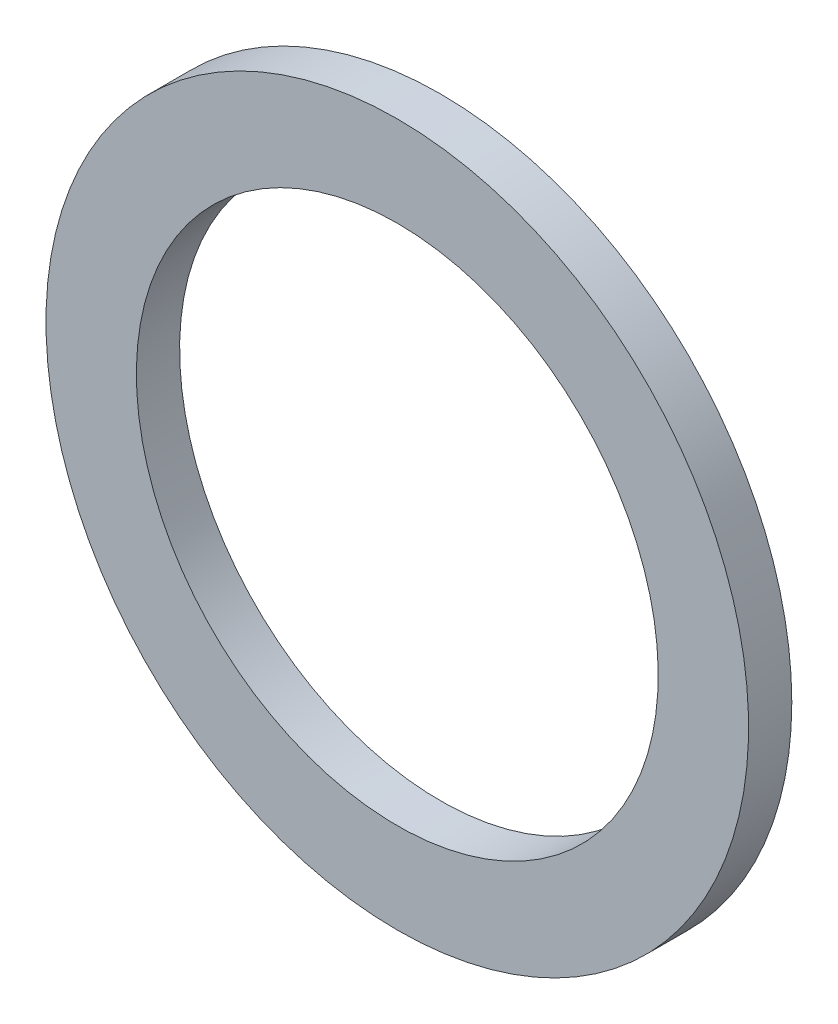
ISO-10303-21;
HEADER;
FILE_DESCRIPTION(('STEP AP214'),'2;1');
FILE_NAME('part.step','',(''),(''),'','','');
FILE_SCHEMA(('AUTOMOTIVE_DESIGN { 1 0 10303 214 1 1 1 1 }'));
ENDSEC;
DATA;
#1=APPLICATION_CONTEXT('core data for automotive mechanical design processes');
#2=APPLICATION_PROTOCOL_DEFINITION('international standard','automotive_design',2000,#1);
#3=PRODUCT_CONTEXT('',#1,'mechanical');
#4=PRODUCT('Part','Part','',(#3));
#5=PRODUCT_RELATED_PRODUCT_CATEGORY('part','',(#4));
#6=PRODUCT_DEFINITION_FORMATION('','',#4);
#7=PRODUCT_DEFINITION_CONTEXT('part definition',#1,'design');
#8=PRODUCT_DEFINITION('design','',#6,#7);
#9=PRODUCT_DEFINITION_SHAPE('','',#8);
#10=(LENGTH_UNIT() NAMED_UNIT(*) SI_UNIT(.MILLI.,.METRE.));
#11=(NAMED_UNIT(*) PLANE_ANGLE_UNIT() SI_UNIT($,.RADIAN.));
#12=(NAMED_UNIT(*) SI_UNIT($,.STERADIAN.) SOLID_ANGLE_UNIT());
#13=UNCERTAINTY_MEASURE_WITH_UNIT(LENGTH_MEASURE(1.E-05),#10,'distance_accuracy_value','');
#14=(GEOMETRIC_REPRESENTATION_CONTEXT(3) GLOBAL_UNCERTAINTY_ASSIGNED_CONTEXT((#13)) GLOBAL_UNIT_ASSIGNED_CONTEXT((#10,
#11,#12)) REPRESENTATION_CONTEXT('',''));
#15=CARTESIAN_POINT('',(0.,0.,0.));
#16=DIRECTION('',(0.,0.,1.));
#17=DIRECTION('',(1.,0.,0.));
#18=AXIS2_PLACEMENT_3D('',#15,#16,#17);
#19=CARTESIAN_POINT('',(-0.530152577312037,200.127831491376,0.));
#20=DIRECTION('',(0.,0.,1.));
#21=DIRECTION('',(1.,0.,0.));
#22=AXIS2_PLACEMENT_3D('',#19,#20,#21);
#23=PLANE('',#22);
#24=CARTESIAN_POINT('',(-0.530152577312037,200.127831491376,0.));
#25=DIRECTION('',(0.,0.,1.));
#26=DIRECTION('',(1.,0.,0.));
#27=AXIS2_PLACEMENT_3D('',#24,#25,#26);
#28=CIRCLE('',#27,16.2593730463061);
#29=CARTESIAN_POINT('',(15.7292204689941,200.127831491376,0.));
#30=VERTEX_POINT('',#29);
#31=EDGE_CURVE('E42',#30,#30,#28,.T.);
#32=ORIENTED_EDGE('',*,*,#31,.F.);
#33=EDGE_LOOP('',(#32));
#34=FACE_BOUND('',#33,.T.);
#35=CARTESIAN_POINT('',(-0.530152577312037,200.127831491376,0.));
#36=DIRECTION('',(0.,0.,1.));
#37=DIRECTION('',(1.,0.,0.));
#38=AXIS2_PLACEMENT_3D('',#35,#36,#37);
#39=CIRCLE('',#38,12.0765217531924);
#40=CARTESIAN_POINT('',(11.5463691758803,200.127831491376,0.));
#41=VERTEX_POINT('',#40);
#42=EDGE_CURVE('E51',#41,#41,#39,.T.);
#43=ORIENTED_EDGE('',*,*,#42,.T.);
#44=EDGE_LOOP('',(#43));
#45=FACE_BOUND('',#44,.T.);
#46=ADVANCED_FACE('F35',(#34,#45),#23,.F.);
#47=CARTESIAN_POINT('',(-0.530152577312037,200.127831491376,47.9884517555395));
#48=DIRECTION('',(0.,0.,-1.));
#49=DIRECTION('',(-1.,0.,0.));
#50=AXIS2_PLACEMENT_3D('',#47,#48,#49);
#51=CYLINDRICAL_SURFACE('',#50,16.2593730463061);
#52=CARTESIAN_POINT('',(-0.530152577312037,200.127831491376,2.00000000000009));
#53=DIRECTION('',(0.,0.,-0.999999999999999));
#54=DIRECTION('',(0.,1.,0.));
#55=AXIS2_PLACEMENT_3D('',#52,#53,#54);
#56=CIRCLE('',#55,16.2593730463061);
#57=CARTESIAN_POINT('',(-0.530152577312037,216.387204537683,2.00000000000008));
#58=VERTEX_POINT('',#57);
#59=EDGE_CURVE('E46',#58,#58,#56,.T.);
#60=ORIENTED_EDGE('',*,*,#59,.T.);
#61=EDGE_LOOP('',(#60));
#62=FACE_BOUND('',#61,.T.);
#63=ORIENTED_EDGE('',*,*,#31,.T.);
#64=EDGE_LOOP('',(#63));
#65=FACE_BOUND('',#64,.T.);
#66=ADVANCED_FACE('F59',(#62,#65),#51,.T.);
#67=CARTESIAN_POINT('',(-0.530152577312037,200.127831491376,47.9884517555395));
#68=DIRECTION('',(0.,0.,-1.));
#69=DIRECTION('',(-1.,0.,0.));
#70=AXIS2_PLACEMENT_3D('',#67,#68,#69);
#71=CYLINDRICAL_SURFACE('',#70,12.0765217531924);
#72=CARTESIAN_POINT('',(-0.530152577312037,200.127831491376,2.00000000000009));
#73=DIRECTION('',(0.,0.,-0.999999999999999));
#74=DIRECTION('',(0.,1.,0.));
#75=AXIS2_PLACEMENT_3D('',#72,#73,#74);
#76=CIRCLE('',#75,12.0765217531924);
#77=CARTESIAN_POINT('',(-0.530152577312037,212.204353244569,2.00000000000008));
#78=VERTEX_POINT('',#77);
#79=EDGE_CURVE('E10',#78,#78,#76,.T.);
#80=ORIENTED_EDGE('',*,*,#79,.F.);
#81=EDGE_LOOP('',(#80));
#82=FACE_BOUND('',#81,.T.);
#83=ORIENTED_EDGE('',*,*,#42,.F.);
#84=EDGE_LOOP('',(#83));
#85=FACE_BOUND('',#84,.T.);
#86=ADVANCED_FACE('F57',(#82,#85),#71,.F.);
#87=CARTESIAN_POINT('',(174.968719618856,203.308648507,2.00000000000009));
#88=DIRECTION('',(0.,0.,-0.999999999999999));
#89=DIRECTION('',(0.392858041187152,-0.919599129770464,0.));
#90=AXIS2_PLACEMENT_3D('',#87,#88,#89);
#91=PLANE('',#90);
#92=ORIENTED_EDGE('',*,*,#79,.T.);
#93=EDGE_LOOP('',(#92));
#94=FACE_BOUND('',#93,.T.);
#95=ORIENTED_EDGE('',*,*,#59,.F.);
#96=EDGE_LOOP('',(#95));
#97=FACE_BOUND('',#96,.T.);
#98=ADVANCED_FACE('F37',(#94,#97),#91,.F.);
#99=CLOSED_SHELL('',(#46,#66,#86,#98));
#100=MANIFOLD_SOLID_BREP('B2',#99);
#101=ADVANCED_BREP_SHAPE_REPRESENTATION('',(#18,#100),#14);
#102=SHAPE_DEFINITION_REPRESENTATION(#9,#101);
ENDSEC;
END-ISO-10303-21;
